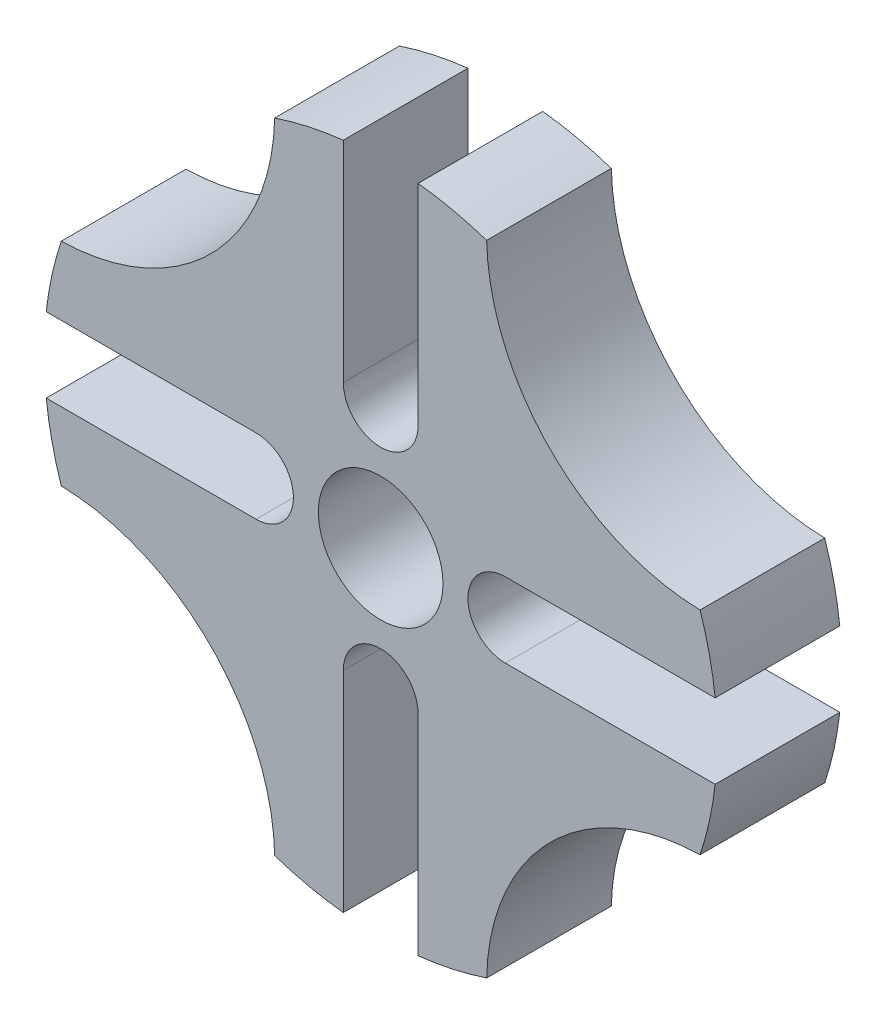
ISO-10303-21;
HEADER;
FILE_DESCRIPTION(('STEP AP214'),'2;1');
FILE_NAME('part.step','',(''),(''),'','','');
FILE_SCHEMA(('AUTOMOTIVE_DESIGN { 1 0 10303 214 1 1 1 1 }'));
ENDSEC;
DATA;
#1=APPLICATION_CONTEXT('core data for automotive mechanical design processes');
#2=APPLICATION_PROTOCOL_DEFINITION('international standard','automotive_design',2000,#1);
#3=PRODUCT_CONTEXT('',#1,'mechanical');
#4=PRODUCT('Part','Part','',(#3));
#5=PRODUCT_RELATED_PRODUCT_CATEGORY('part','',(#4));
#6=PRODUCT_DEFINITION_FORMATION('','',#4);
#7=PRODUCT_DEFINITION_CONTEXT('part definition',#1,'design');
#8=PRODUCT_DEFINITION('design','',#6,#7);
#9=PRODUCT_DEFINITION_SHAPE('','',#8);
#10=(LENGTH_UNIT() NAMED_UNIT(*) SI_UNIT(.MILLI.,.METRE.));
#11=(NAMED_UNIT(*) PLANE_ANGLE_UNIT() SI_UNIT($,.RADIAN.));
#12=(NAMED_UNIT(*) SI_UNIT($,.STERADIAN.) SOLID_ANGLE_UNIT());
#13=UNCERTAINTY_MEASURE_WITH_UNIT(LENGTH_MEASURE(1.E-05),#10,'distance_accuracy_value','');
#14=(GEOMETRIC_REPRESENTATION_CONTEXT(3) GLOBAL_UNCERTAINTY_ASSIGNED_CONTEXT((#13)) GLOBAL_UNIT_ASSIGNED_CONTEXT((#10,
#11,#12)) REPRESENTATION_CONTEXT('',''));
#15=CARTESIAN_POINT('',(0.,0.,0.));
#16=DIRECTION('',(0.,0.,1.));
#17=DIRECTION('',(1.,0.,0.));
#18=AXIS2_PLACEMENT_3D('',#15,#16,#17);
#19=CARTESIAN_POINT('',(0.,0.,10.));
#20=DIRECTION('',(0.,0.,-1.));
#21=DIRECTION('',(-1.,0.,0.));
#22=AXIS2_PLACEMENT_3D('',#19,#20,#21);
#23=CYLINDRICAL_SURFACE('',#22,27.);
#24=CARTESIAN_POINT('',(0.,0.,0.));
#25=DIRECTION('',(0.,0.,1.));
#26=DIRECTION('',(1.,0.,0.));
#27=AXIS2_PLACEMENT_3D('',#24,#25,#26);
#28=CIRCLE('',#27,27.);
#29=CARTESIAN_POINT('',(-2.99999999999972,26.8328157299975,0.));
#30=VERTEX_POINT('',#29);
#31=CARTESIAN_POINT('',(-8.50400104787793,25.6258066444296,0.));
#32=VERTEX_POINT('',#31);
#33=EDGE_CURVE('E365',#30,#32,#28,.T.);
#34=ORIENTED_EDGE('',*,*,#33,.T.);
#35=DIRECTION('',(0.,0.,1.));
#36=VECTOR('',#35,1.);
#37=CARTESIAN_POINT('',(-8.50400104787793,25.6258066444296,0.));
#38=LINE('',#37,#36);
#39=CARTESIAN_POINT('',(-8.50400104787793,25.6258066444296,10.));
#40=VERTEX_POINT('',#39);
#41=EDGE_CURVE('E59',#32,#40,#38,.T.);
#42=ORIENTED_EDGE('',*,*,#41,.T.);
#43=CARTESIAN_POINT('',(0.,0.,10.));
#44=DIRECTION('',(0.,0.,1.));
#45=DIRECTION('',(1.,0.,0.));
#46=AXIS2_PLACEMENT_3D('',#43,#44,#45);
#47=CIRCLE('',#46,27.);
#48=CARTESIAN_POINT('',(-2.99999999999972,26.8328157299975,10.));
#49=VERTEX_POINT('',#48);
#50=EDGE_CURVE('E220',#49,#40,#47,.T.);
#51=ORIENTED_EDGE('',*,*,#50,.F.);
#52=DIRECTION('',(0.,0.,1.));
#53=VECTOR('',#52,1.);
#54=CARTESIAN_POINT('',(-2.99999999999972,26.8328157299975,0.));
#55=LINE('',#54,#53);
#56=EDGE_CURVE('E266',#30,#49,#55,.T.);
#57=ORIENTED_EDGE('',*,*,#56,.F.);
#58=EDGE_LOOP('',(#34,#42,#51,#57));
#59=FACE_BOUND('',#58,.T.);
#60=ADVANCED_FACE('F42',(#59),#23,.T.);
#61=CARTESIAN_POINT('',(-26.8328157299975,-2.99999999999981,0.));
#62=VERTEX_POINT('',#61);
#63=CARTESIAN_POINT('',(-25.6258066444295,-8.50400104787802,0.));
#64=VERTEX_POINT('',#63);
#65=EDGE_CURVE('E364',#62,#64,#28,.T.);
#66=ORIENTED_EDGE('',*,*,#65,.T.);
#67=DIRECTION('',(0.,0.,1.));
#68=VECTOR('',#67,1.);
#69=CARTESIAN_POINT('',(-25.6258066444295,-8.50400104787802,0.));
#70=LINE('',#69,#68);
#71=CARTESIAN_POINT('',(-25.6258066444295,-8.50400104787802,10.));
#72=VERTEX_POINT('',#71);
#73=EDGE_CURVE('E67',#64,#72,#70,.T.);
#74=ORIENTED_EDGE('',*,*,#73,.T.);
#75=CARTESIAN_POINT('',(-26.8328157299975,-2.99999999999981,10.));
#76=VERTEX_POINT('',#75);
#77=EDGE_CURVE('E226',#76,#72,#47,.T.);
#78=ORIENTED_EDGE('',*,*,#77,.F.);
#79=DIRECTION('',(0.,0.,1.));
#80=VECTOR('',#79,1.);
#81=CARTESIAN_POINT('',(-26.8328157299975,-2.99999999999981,0.));
#82=LINE('',#81,#80);
#83=EDGE_CURVE('E295',#62,#76,#82,.T.);
#84=ORIENTED_EDGE('',*,*,#83,.F.);
#85=EDGE_LOOP('',(#66,#74,#78,#84));
#86=FACE_BOUND('',#85,.T.);
#87=ADVANCED_FACE('F433',(#86),#23,.T.);
#88=CARTESIAN_POINT('',(2.99999999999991,-26.8328157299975,0.));
#89=VERTEX_POINT('',#88);
#90=CARTESIAN_POINT('',(8.50400104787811,-25.6258066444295,0.));
#91=VERTEX_POINT('',#90);
#92=EDGE_CURVE('E243',#89,#91,#28,.T.);
#93=ORIENTED_EDGE('',*,*,#92,.T.);
#94=DIRECTION('',(0.,0.,1.));
#95=VECTOR('',#94,1.);
#96=CARTESIAN_POINT('',(8.50400104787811,-25.6258066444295,0.));
#97=LINE('',#96,#95);
#98=CARTESIAN_POINT('',(8.50400104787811,-25.6258066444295,10.));
#99=VERTEX_POINT('',#98);
#100=EDGE_CURVE('E396',#91,#99,#97,.T.);
#101=ORIENTED_EDGE('',*,*,#100,.T.);
#102=CARTESIAN_POINT('',(2.99999999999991,-26.8328157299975,10.));
#103=VERTEX_POINT('',#102);
#104=EDGE_CURVE('E52',#103,#99,#47,.T.);
#105=ORIENTED_EDGE('',*,*,#104,.F.);
#106=DIRECTION('',(0.,0.,1.));
#107=VECTOR('',#106,1.);
#108=CARTESIAN_POINT('',(2.99999999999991,-26.8328157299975,0.));
#109=LINE('',#108,#107);
#110=EDGE_CURVE('E319',#89,#103,#109,.T.);
#111=ORIENTED_EDGE('',*,*,#110,.F.);
#112=EDGE_LOOP('',(#93,#101,#105,#111));
#113=FACE_BOUND('',#112,.T.);
#114=ADVANCED_FACE('F437',(#113),#23,.T.);
#115=CARTESIAN_POINT('',(26.8328157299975,3.,0.));
#116=VERTEX_POINT('',#115);
#117=CARTESIAN_POINT('',(25.6258066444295,8.50400104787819,0.));
#118=VERTEX_POINT('',#117);
#119=EDGE_CURVE('E235',#116,#118,#28,.T.);
#120=ORIENTED_EDGE('',*,*,#119,.T.);
#121=DIRECTION('',(0.,0.,1.));
#122=VECTOR('',#121,1.);
#123=CARTESIAN_POINT('',(25.6258066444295,8.50400104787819,0.));
#124=LINE('',#123,#122);
#125=CARTESIAN_POINT('',(25.6258066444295,8.50400104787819,10.));
#126=VERTEX_POINT('',#125);
#127=EDGE_CURVE('E405',#118,#126,#124,.T.);
#128=ORIENTED_EDGE('',*,*,#127,.T.);
#129=CARTESIAN_POINT('',(26.8328157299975,3.,10.));
#130=VERTEX_POINT('',#129);
#131=EDGE_CURVE('E11',#130,#126,#47,.T.);
#132=ORIENTED_EDGE('',*,*,#131,.F.);
#133=DIRECTION('',(0.,0.,1.));
#134=VECTOR('',#133,1.);
#135=CARTESIAN_POINT('',(26.8328157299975,3.,0.));
#136=LINE('',#135,#134);
#137=EDGE_CURVE('E345',#116,#130,#136,.T.);
#138=ORIENTED_EDGE('',*,*,#137,.F.);
#139=EDGE_LOOP('',(#120,#128,#132,#138));
#140=FACE_BOUND('',#139,.T.);
#141=ADVANCED_FACE('F467',(#140),#23,.T.);
#142=CARTESIAN_POINT('',(-25.6258066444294,8.50400104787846,10.));
#143=VERTEX_POINT('',#142);
#144=CARTESIAN_POINT('',(-26.8328157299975,3.00000000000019,10.));
#145=VERTEX_POINT('',#144);
#146=EDGE_CURVE('E51',#143,#145,#47,.T.);
#147=ORIENTED_EDGE('',*,*,#146,.F.);
#148=DIRECTION('',(0.,0.,1.));
#149=VECTOR('',#148,1.);
#150=CARTESIAN_POINT('',(-25.6258066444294,8.50400104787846,0.));
#151=LINE('',#150,#149);
#152=CARTESIAN_POINT('',(-25.6258066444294,8.50400104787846,0.));
#153=VERTEX_POINT('',#152);
#154=EDGE_CURVE('E203',#153,#143,#151,.T.);
#155=ORIENTED_EDGE('',*,*,#154,.F.);
#156=CARTESIAN_POINT('',(-26.8328157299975,3.00000000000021,0.));
#157=VERTEX_POINT('',#156);
#158=EDGE_CURVE('E242',#153,#157,#28,.T.);
#159=ORIENTED_EDGE('',*,*,#158,.T.);
#160=DIRECTION('',(0.,0.,1.));
#161=VECTOR('',#160,1.);
#162=CARTESIAN_POINT('',(-26.8328157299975,3.00000000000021,0.));
#163=LINE('',#162,#161);
#164=EDGE_CURVE('E225',#157,#145,#163,.T.);
#165=ORIENTED_EDGE('',*,*,#164,.T.);
#166=EDGE_LOOP('',(#147,#155,#159,#165));
#167=FACE_BOUND('',#166,.T.);
#168=ADVANCED_FACE('F223',(#167),#23,.T.);
#169=CARTESIAN_POINT('',(-8.50400104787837,-25.6258066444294,10.));
#170=VERTEX_POINT('',#169);
#171=CARTESIAN_POINT('',(-3.00000000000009,-26.8328157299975,10.));
#172=VERTEX_POINT('',#171);
#173=EDGE_CURVE('E227',#170,#172,#47,.T.);
#174=ORIENTED_EDGE('',*,*,#173,.F.);
#175=DIRECTION('',(0.,0.,1.));
#176=VECTOR('',#175,1.);
#177=CARTESIAN_POINT('',(-8.50400104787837,-25.6258066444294,0.));
#178=LINE('',#177,#176);
#179=CARTESIAN_POINT('',(-8.50400104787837,-25.6258066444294,0.));
#180=VERTEX_POINT('',#179);
#181=EDGE_CURVE('E387',#180,#170,#178,.T.);
#182=ORIENTED_EDGE('',*,*,#181,.F.);
#183=CARTESIAN_POINT('',(-3.00000000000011,-26.8328157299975,0.));
#184=VERTEX_POINT('',#183);
#185=EDGE_CURVE('E358',#180,#184,#28,.T.);
#186=ORIENTED_EDGE('',*,*,#185,.T.);
#187=DIRECTION('',(0.,0.,1.));
#188=VECTOR('',#187,1.);
#189=CARTESIAN_POINT('',(-3.00000000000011,-26.8328157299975,0.));
#190=LINE('',#189,#188);
#191=EDGE_CURVE('E321',#184,#172,#190,.T.);
#192=ORIENTED_EDGE('',*,*,#191,.T.);
#193=EDGE_LOOP('',(#174,#182,#186,#192));
#194=FACE_BOUND('',#193,.T.);
#195=ADVANCED_FACE('F450',(#194),#23,.T.);
#196=CARTESIAN_POINT('',(25.6258066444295,-8.50400104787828,10.));
#197=VERTEX_POINT('',#196);
#198=CARTESIAN_POINT('',(26.8328157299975,-3.,10.));
#199=VERTEX_POINT('',#198);
#200=EDGE_CURVE('E229',#197,#199,#47,.T.);
#201=ORIENTED_EDGE('',*,*,#200,.F.);
#202=DIRECTION('',(0.,0.,1.));
#203=VECTOR('',#202,1.);
#204=CARTESIAN_POINT('',(25.6258066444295,-8.50400104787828,0.));
#205=LINE('',#204,#203);
#206=CARTESIAN_POINT('',(25.6258066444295,-8.50400104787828,0.));
#207=VERTEX_POINT('',#206);
#208=EDGE_CURVE('E395',#207,#197,#205,.T.);
#209=ORIENTED_EDGE('',*,*,#208,.F.);
#210=CARTESIAN_POINT('',(26.8328157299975,-3.00000000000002,0.));
#211=VERTEX_POINT('',#210);
#212=EDGE_CURVE('E355',#207,#211,#28,.T.);
#213=ORIENTED_EDGE('',*,*,#212,.T.);
#214=DIRECTION('',(0.,0.,1.));
#215=VECTOR('',#214,1.);
#216=CARTESIAN_POINT('',(26.8328157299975,-3.00000000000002,0.));
#217=LINE('',#216,#215);
#218=EDGE_CURVE('E347',#211,#199,#217,.T.);
#219=ORIENTED_EDGE('',*,*,#218,.T.);
#220=EDGE_LOOP('',(#201,#209,#213,#219));
#221=FACE_BOUND('',#220,.T.);
#222=ADVANCED_FACE('F441',(#221),#23,.T.);
#223=CARTESIAN_POINT('',(0.,0.,10.));
#224=DIRECTION('',(0.,0.,1.));
#225=DIRECTION('',(1.,0.,0.));
#226=AXIS2_PLACEMENT_3D('',#223,#224,#225);
#227=PLANE('',#226);
#228=CARTESIAN_POINT('',(-25.9999999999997,26.0000000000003,10.));
#229=DIRECTION('',(0.,0.,1.));
#230=DIRECTION('',(0.,1.,0.));
#231=AXIS2_PLACEMENT_3D('',#228,#229,#230);
#232=CIRCLE('',#231,17.5);
#233=EDGE_CURVE('E206',#143,#40,#232,.T.);
#234=ORIENTED_EDGE('',*,*,#233,.F.);
#235=ORIENTED_EDGE('',*,*,#146,.T.);
#236=DIRECTION('',(-1.,0.,0.));
#237=VECTOR('',#236,1.);
#238=CARTESIAN_POINT('',(-9.99999999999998,3.00000000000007,10.));
#239=LINE('',#238,#237);
#240=CARTESIAN_POINT('',(-9.99999999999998,3.00000000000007,10.));
#241=VERTEX_POINT('',#240);
#242=EDGE_CURVE('E277',#241,#145,#239,.T.);
#243=ORIENTED_EDGE('',*,*,#242,.F.);
#244=CARTESIAN_POINT('',(-10.,0.,10.));
#245=DIRECTION('',(0.,0.,1.));
#246=DIRECTION('',(-1.,0.,0.));
#247=AXIS2_PLACEMENT_3D('',#244,#245,#246);
#248=CIRCLE('',#247,3.);
#249=CARTESIAN_POINT('',(-10.,-2.99999999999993,10.));
#250=VERTEX_POINT('',#249);
#251=EDGE_CURVE('E274',#250,#241,#248,.T.);
#252=ORIENTED_EDGE('',*,*,#251,.F.);
#253=DIRECTION('',(1.,0.,0.));
#254=VECTOR('',#253,1.);
#255=CARTESIAN_POINT('',(-10.,-2.99999999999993,10.));
#256=LINE('',#255,#254);
#257=EDGE_CURVE('E279',#76,#250,#256,.T.);
#258=ORIENTED_EDGE('',*,*,#257,.F.);
#259=ORIENTED_EDGE('',*,*,#77,.T.);
#260=CARTESIAN_POINT('',(-26.0000000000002,-25.9999999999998,10.));
#261=DIRECTION('',(0.,0.,1.));
#262=DIRECTION('',(-1.,0.,0.));
#263=AXIS2_PLACEMENT_3D('',#260,#261,#262);
#264=CIRCLE('',#263,17.5);
#265=EDGE_CURVE('E382',#170,#72,#264,.T.);
#266=ORIENTED_EDGE('',*,*,#265,.F.);
#267=ORIENTED_EDGE('',*,*,#173,.T.);
#268=DIRECTION('',(0.,-1.,0.));
#269=VECTOR('',#268,1.);
#270=CARTESIAN_POINT('',(-3.00000000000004,-9.99999999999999,10.));
#271=LINE('',#270,#269);
#272=CARTESIAN_POINT('',(-3.00000000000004,-9.99999999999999,10.));
#273=VERTEX_POINT('',#272);
#274=EDGE_CURVE('E301',#273,#172,#271,.T.);
#275=ORIENTED_EDGE('',*,*,#274,.F.);
#276=CARTESIAN_POINT('',(0.,-10.,10.));
#277=DIRECTION('',(0.,0.,1.));
#278=DIRECTION('',(0.,-1.,0.));
#279=AXIS2_PLACEMENT_3D('',#276,#277,#278);
#280=CIRCLE('',#279,3.);
#281=CARTESIAN_POINT('',(2.99999999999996,-10.,10.));
#282=VERTEX_POINT('',#281);
#283=EDGE_CURVE('E294',#282,#273,#280,.T.);
#284=ORIENTED_EDGE('',*,*,#283,.F.);
#285=DIRECTION('',(0.,1.,0.));
#286=VECTOR('',#285,1.);
#287=CARTESIAN_POINT('',(2.99999999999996,-10.,10.));
#288=LINE('',#287,#286);
#289=EDGE_CURVE('E303',#103,#282,#288,.T.);
#290=ORIENTED_EDGE('',*,*,#289,.F.);
#291=ORIENTED_EDGE('',*,*,#104,.T.);
#292=CARTESIAN_POINT('',(25.9999999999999,-26.0000000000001,10.));
#293=DIRECTION('',(0.,0.,1.));
#294=DIRECTION('',(0.,-1.,0.));
#295=AXIS2_PLACEMENT_3D('',#292,#293,#294);
#296=CIRCLE('',#295,17.5);
#297=EDGE_CURVE('E389',#197,#99,#296,.T.);
#298=ORIENTED_EDGE('',*,*,#297,.F.);
#299=ORIENTED_EDGE('',*,*,#200,.T.);
#300=DIRECTION('',(1.,0.,0.));
#301=VECTOR('',#300,1.);
#302=CARTESIAN_POINT('',(10.,-3.,10.));
#303=LINE('',#302,#301);
#304=CARTESIAN_POINT('',(10.,-3.,10.));
#305=VERTEX_POINT('',#304);
#306=EDGE_CURVE('E327',#305,#199,#303,.T.);
#307=ORIENTED_EDGE('',*,*,#306,.F.);
#308=CARTESIAN_POINT('',(10.,0.,10.));
#309=DIRECTION('',(0.,0.,1.));
#310=DIRECTION('',(1.,0.,0.));
#311=AXIS2_PLACEMENT_3D('',#308,#309,#310);
#312=CIRCLE('',#311,3.);
#313=CARTESIAN_POINT('',(10.,3.,10.));
#314=VERTEX_POINT('',#313);
#315=EDGE_CURVE('E318',#314,#305,#312,.T.);
#316=ORIENTED_EDGE('',*,*,#315,.F.);
#317=DIRECTION('',(-1.,0.,0.));
#318=VECTOR('',#317,1.);
#319=CARTESIAN_POINT('',(10.,3.,10.));
#320=LINE('',#319,#318);
#321=EDGE_CURVE('E329',#130,#314,#320,.T.);
#322=ORIENTED_EDGE('',*,*,#321,.F.);
#323=ORIENTED_EDGE('',*,*,#131,.T.);
#324=CARTESIAN_POINT('',(26.,26.,10.));
#325=DIRECTION('',(0.,0.,1.));
#326=DIRECTION('',(1.,0.,0.));
#327=AXIS2_PLACEMENT_3D('',#324,#325,#326);
#328=CIRCLE('',#327,17.5);
#329=CARTESIAN_POINT('',(8.50400104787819,25.6258066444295,10.));
#330=VERTEX_POINT('',#329);
#331=EDGE_CURVE('E250',#330,#126,#328,.T.);
#332=ORIENTED_EDGE('',*,*,#331,.F.);
#333=CARTESIAN_POINT('',(3.00000000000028,26.8328157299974,10.));
#334=VERTEX_POINT('',#333);
#335=EDGE_CURVE('E50',#330,#334,#47,.T.);
#336=ORIENTED_EDGE('',*,*,#335,.T.);
#337=DIRECTION('',(0.,1.,0.));
#338=VECTOR('',#337,1.);
#339=CARTESIAN_POINT('',(3.0000000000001,9.99999999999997,10.));
#340=LINE('',#339,#338);
#341=CARTESIAN_POINT('',(3.0000000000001,9.99999999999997,10.));
#342=VERTEX_POINT('',#341);
#343=EDGE_CURVE('E249',#342,#334,#340,.T.);
#344=ORIENTED_EDGE('',*,*,#343,.F.);
#345=CARTESIAN_POINT('',(1.04744500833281E-13,10.,10.));
#346=DIRECTION('',(0.,0.,1.));
#347=DIRECTION('',(0.,1.,0.));
#348=AXIS2_PLACEMENT_3D('',#345,#346,#347);
#349=CIRCLE('',#348,3.);
#350=CARTESIAN_POINT('',(-2.9999999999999,10.,10.));
#351=VERTEX_POINT('',#350);
#352=EDGE_CURVE('E263',#351,#342,#349,.T.);
#353=ORIENTED_EDGE('',*,*,#352,.F.);
#354=DIRECTION('',(0.,-1.,0.));
#355=VECTOR('',#354,1.);
#356=CARTESIAN_POINT('',(-2.9999999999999,10.,10.));
#357=LINE('',#356,#355);
#358=EDGE_CURVE('E262',#49,#351,#357,.T.);
#359=ORIENTED_EDGE('',*,*,#358,.F.);
#360=ORIENTED_EDGE('',*,*,#50,.T.);
#361=EDGE_LOOP('',(#234,#235,#243,#252,#258,#259,#266,#267,#275,#284,#290,#291,#298,#299,#307,
#316,#322,#323,#332,#336,#344,#353,#359,#360));
#362=FACE_BOUND('',#361,.T.);
#363=CARTESIAN_POINT('',(0.,0.,10.));
#364=DIRECTION('',(0.,0.,1.));
#365=DIRECTION('',(1.,0.,0.));
#366=AXIS2_PLACEMENT_3D('',#363,#364,#365);
#367=CIRCLE('',#366,5.);
#368=CARTESIAN_POINT('',(5.,0.,10.));
#369=VERTEX_POINT('',#368);
#370=EDGE_CURVE('E353',#369,#369,#367,.T.);
#371=ORIENTED_EDGE('',*,*,#370,.F.);
#372=EDGE_LOOP('',(#371));
#373=FACE_BOUND('',#372,.T.);
#374=ADVANCED_FACE('F214',(#362,#373),#227,.T.);
#375=CARTESIAN_POINT('',(0.,0.,0.));
#376=DIRECTION('',(0.,0.,1.));
#377=DIRECTION('',(1.,0.,0.));
#378=AXIS2_PLACEMENT_3D('',#375,#376,#377);
#379=PLANE('',#378);
#380=ORIENTED_EDGE('',*,*,#158,.F.);
#381=CARTESIAN_POINT('',(-25.9999999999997,26.0000000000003,0.));
#382=DIRECTION('',(0.,0.,1.));
#383=DIRECTION('',(0.,1.,0.));
#384=AXIS2_PLACEMENT_3D('',#381,#382,#383);
#385=CIRCLE('',#384,17.5);
#386=EDGE_CURVE('E207',#153,#32,#385,.T.);
#387=ORIENTED_EDGE('',*,*,#386,.T.);
#388=ORIENTED_EDGE('',*,*,#33,.F.);
#389=DIRECTION('',(0.,-1.,0.));
#390=VECTOR('',#389,1.);
#391=CARTESIAN_POINT('',(-2.9999999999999,10.,0.));
#392=LINE('',#391,#390);
#393=CARTESIAN_POINT('',(-2.9999999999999,10.,0.));
#394=VERTEX_POINT('',#393);
#395=EDGE_CURVE('E270',#30,#394,#392,.T.);
#396=ORIENTED_EDGE('',*,*,#395,.T.);
#397=CARTESIAN_POINT('',(1.04744500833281E-13,10.,0.));
#398=DIRECTION('',(0.,0.,1.));
#399=DIRECTION('',(0.,1.,0.));
#400=AXIS2_PLACEMENT_3D('',#397,#398,#399);
#401=CIRCLE('',#400,3.);
#402=CARTESIAN_POINT('',(3.0000000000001,9.99999999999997,0.));
#403=VERTEX_POINT('',#402);
#404=EDGE_CURVE('E412',#394,#403,#401,.T.);
#405=ORIENTED_EDGE('',*,*,#404,.T.);
#406=DIRECTION('',(0.,1.,0.));
#407=VECTOR('',#406,1.);
#408=CARTESIAN_POINT('',(3.0000000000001,9.99999999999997,0.));
#409=LINE('',#408,#407);
#410=CARTESIAN_POINT('',(3.0000000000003,26.8328157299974,0.));
#411=VERTEX_POINT('',#410);
#412=EDGE_CURVE('E414',#403,#411,#409,.T.);
#413=ORIENTED_EDGE('',*,*,#412,.T.);
#414=CARTESIAN_POINT('',(8.50400104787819,25.6258066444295,0.));
#415=VERTEX_POINT('',#414);
#416=EDGE_CURVE('E241',#415,#411,#28,.T.);
#417=ORIENTED_EDGE('',*,*,#416,.F.);
#418=CARTESIAN_POINT('',(26.,26.,0.));
#419=DIRECTION('',(0.,0.,1.));
#420=DIRECTION('',(1.,0.,0.));
#421=AXIS2_PLACEMENT_3D('',#418,#419,#420);
#422=CIRCLE('',#421,17.5);
#423=EDGE_CURVE('E401',#415,#118,#422,.T.);
#424=ORIENTED_EDGE('',*,*,#423,.T.);
#425=ORIENTED_EDGE('',*,*,#119,.F.);
#426=DIRECTION('',(-1.,0.,0.));
#427=VECTOR('',#426,1.);
#428=CARTESIAN_POINT('',(10.,3.,0.));
#429=LINE('',#428,#427);
#430=CARTESIAN_POINT('',(10.,3.,0.));
#431=VERTEX_POINT('',#430);
#432=EDGE_CURVE('E338',#116,#431,#429,.T.);
#433=ORIENTED_EDGE('',*,*,#432,.T.);
#434=CARTESIAN_POINT('',(10.,0.,0.));
#435=DIRECTION('',(0.,0.,1.));
#436=DIRECTION('',(1.,0.,0.));
#437=AXIS2_PLACEMENT_3D('',#434,#435,#436);
#438=CIRCLE('',#437,3.);
#439=CARTESIAN_POINT('',(10.,-3.,0.));
#440=VERTEX_POINT('',#439);
#441=EDGE_CURVE('E332',#431,#440,#438,.T.);
#442=ORIENTED_EDGE('',*,*,#441,.T.);
#443=DIRECTION('',(1.,0.,0.));
#444=VECTOR('',#443,1.);
#445=CARTESIAN_POINT('',(10.,-3.,0.));
#446=LINE('',#445,#444);
#447=EDGE_CURVE('E335',#440,#211,#446,.T.);
#448=ORIENTED_EDGE('',*,*,#447,.T.);
#449=ORIENTED_EDGE('',*,*,#212,.F.);
#450=CARTESIAN_POINT('',(25.9999999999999,-26.0000000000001,0.));
#451=DIRECTION('',(0.,0.,1.));
#452=DIRECTION('',(0.,-1.,0.));
#453=AXIS2_PLACEMENT_3D('',#450,#451,#452);
#454=CIRCLE('',#453,17.5);
#455=EDGE_CURVE('E392',#207,#91,#454,.T.);
#456=ORIENTED_EDGE('',*,*,#455,.T.);
#457=ORIENTED_EDGE('',*,*,#92,.F.);
#458=DIRECTION('',(0.,1.,0.));
#459=VECTOR('',#458,1.);
#460=CARTESIAN_POINT('',(2.99999999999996,-10.,0.));
#461=LINE('',#460,#459);
#462=CARTESIAN_POINT('',(2.99999999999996,-10.,0.));
#463=VERTEX_POINT('',#462);
#464=EDGE_CURVE('E312',#89,#463,#461,.T.);
#465=ORIENTED_EDGE('',*,*,#464,.T.);
#466=CARTESIAN_POINT('',(0.,-10.,0.));
#467=DIRECTION('',(0.,0.,1.));
#468=DIRECTION('',(0.,-1.,0.));
#469=AXIS2_PLACEMENT_3D('',#466,#467,#468);
#470=CIRCLE('',#469,3.);
#471=CARTESIAN_POINT('',(-3.00000000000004,-9.99999999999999,0.));
#472=VERTEX_POINT('',#471);
#473=EDGE_CURVE('E306',#463,#472,#470,.T.);
#474=ORIENTED_EDGE('',*,*,#473,.T.);
#475=DIRECTION('',(0.,-1.,0.));
#476=VECTOR('',#475,1.);
#477=CARTESIAN_POINT('',(-3.00000000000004,-9.99999999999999,0.));
#478=LINE('',#477,#476);
#479=EDGE_CURVE('E309',#472,#184,#478,.T.);
#480=ORIENTED_EDGE('',*,*,#479,.T.);
#481=ORIENTED_EDGE('',*,*,#185,.F.);
#482=CARTESIAN_POINT('',(-26.0000000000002,-25.9999999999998,0.));
#483=DIRECTION('',(0.,0.,1.));
#484=DIRECTION('',(-1.,0.,0.));
#485=AXIS2_PLACEMENT_3D('',#482,#483,#484);
#486=CIRCLE('',#485,17.5);
#487=EDGE_CURVE('E385',#180,#64,#486,.T.);
#488=ORIENTED_EDGE('',*,*,#487,.T.);
#489=ORIENTED_EDGE('',*,*,#65,.F.);
#490=DIRECTION('',(1.,0.,0.));
#491=VECTOR('',#490,1.);
#492=CARTESIAN_POINT('',(-10.,-2.99999999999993,0.));
#493=LINE('',#492,#491);
#494=CARTESIAN_POINT('',(-10.,-2.99999999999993,0.));
#495=VERTEX_POINT('',#494);
#496=EDGE_CURVE('E288',#62,#495,#493,.T.);
#497=ORIENTED_EDGE('',*,*,#496,.T.);
#498=CARTESIAN_POINT('',(-10.,0.,0.));
#499=DIRECTION('',(0.,0.,1.));
#500=DIRECTION('',(-1.,0.,0.));
#501=AXIS2_PLACEMENT_3D('',#498,#499,#500);
#502=CIRCLE('',#501,3.);
#503=CARTESIAN_POINT('',(-9.99999999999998,3.00000000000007,0.));
#504=VERTEX_POINT('',#503);
#505=EDGE_CURVE('E282',#495,#504,#502,.T.);
#506=ORIENTED_EDGE('',*,*,#505,.T.);
#507=DIRECTION('',(-1.,0.,0.));
#508=VECTOR('',#507,1.);
#509=CARTESIAN_POINT('',(-9.99999999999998,3.00000000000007,0.));
#510=LINE('',#509,#508);
#511=EDGE_CURVE('E285',#504,#157,#510,.T.);
#512=ORIENTED_EDGE('',*,*,#511,.T.);
#513=EDGE_LOOP('',(#380,#387,#388,#396,#405,#413,#417,#424,#425,#433,#442,#448,#449,#456,#457,
#465,#474,#480,#481,#488,#489,#497,#506,#512));
#514=FACE_BOUND('',#513,.T.);
#515=CARTESIAN_POINT('',(0.,0.,0.));
#516=DIRECTION('',(0.,0.,1.));
#517=DIRECTION('',(1.,0.,0.));
#518=AXIS2_PLACEMENT_3D('',#515,#516,#517);
#519=CIRCLE('',#518,5.);
#520=CARTESIAN_POINT('',(5.,0.,0.));
#521=VERTEX_POINT('',#520);
#522=EDGE_CURVE('E344',#521,#521,#519,.T.);
#523=ORIENTED_EDGE('',*,*,#522,.T.);
#524=EDGE_LOOP('',(#523));
#525=FACE_BOUND('',#524,.T.);
#526=ADVANCED_FACE('F377',(#514,#525),#379,.F.);
#527=ORIENTED_EDGE('',*,*,#335,.F.);
#528=DIRECTION('',(0.,0.,1.));
#529=VECTOR('',#528,1.);
#530=CARTESIAN_POINT('',(8.50400104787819,25.6258066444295,0.));
#531=LINE('',#530,#529);
#532=EDGE_CURVE('E404',#415,#330,#531,.T.);
#533=ORIENTED_EDGE('',*,*,#532,.F.);
#534=ORIENTED_EDGE('',*,*,#416,.T.);
#535=DIRECTION('',(0.,0.,1.));
#536=VECTOR('',#535,1.);
#537=CARTESIAN_POINT('',(3.0000000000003,26.8328157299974,0.));
#538=LINE('',#537,#536);
#539=EDGE_CURVE('E258',#411,#334,#538,.T.);
#540=ORIENTED_EDGE('',*,*,#539,.T.);
#541=EDGE_LOOP('',(#527,#533,#534,#540));
#542=FACE_BOUND('',#541,.T.);
#543=ADVANCED_FACE('F44',(#542),#23,.T.);
#544=CARTESIAN_POINT('',(0.,0.,10.));
#545=DIRECTION('',(0.,0.,-1.));
#546=DIRECTION('',(-1.,0.,0.));
#547=AXIS2_PLACEMENT_3D('',#544,#545,#546);
#548=CYLINDRICAL_SURFACE('',#547,5.);
#549=ORIENTED_EDGE('',*,*,#370,.T.);
#550=EDGE_LOOP('',(#549));
#551=FACE_BOUND('',#550,.T.);
#552=ORIENTED_EDGE('',*,*,#522,.F.);
#553=EDGE_LOOP('',(#552));
#554=FACE_BOUND('',#553,.T.);
#555=ADVANCED_FACE('F440',(#551,#554),#548,.F.);
#556=CARTESIAN_POINT('',(10.,0.,0.));
#557=DIRECTION('',(0.,0.,1.));
#558=DIRECTION('',(1.,0.,0.));
#559=AXIS2_PLACEMENT_3D('',#556,#557,#558);
#560=CYLINDRICAL_SURFACE('',#559,3.);
#561=ORIENTED_EDGE('',*,*,#315,.T.);
#562=DIRECTION('',(0.,0.,1.));
#563=VECTOR('',#562,1.);
#564=CARTESIAN_POINT('',(10.,-3.,0.));
#565=LINE('',#564,#563);
#566=EDGE_CURVE('E341',#440,#305,#565,.T.);
#567=ORIENTED_EDGE('',*,*,#566,.F.);
#568=ORIENTED_EDGE('',*,*,#441,.F.);
#569=DIRECTION('',(0.,0.,1.));
#570=VECTOR('',#569,1.);
#571=CARTESIAN_POINT('',(10.,3.,0.));
#572=LINE('',#571,#570);
#573=EDGE_CURVE('E342',#431,#314,#572,.T.);
#574=ORIENTED_EDGE('',*,*,#573,.T.);
#575=EDGE_LOOP('',(#561,#567,#568,#574));
#576=FACE_BOUND('',#575,.T.);
#577=ADVANCED_FACE('F446',(#576),#560,.F.);
#578=CARTESIAN_POINT('',(10.,3.,0.));
#579=DIRECTION('',(0.,1.,0.));
#580=DIRECTION('',(0.,0.,1.));
#581=AXIS2_PLACEMENT_3D('',#578,#579,#580);
#582=PLANE('',#581);
#583=ORIENTED_EDGE('',*,*,#321,.T.);
#584=ORIENTED_EDGE('',*,*,#573,.F.);
#585=ORIENTED_EDGE('',*,*,#432,.F.);
#586=ORIENTED_EDGE('',*,*,#137,.T.);
#587=EDGE_LOOP('',(#583,#584,#585,#586));
#588=FACE_BOUND('',#587,.T.);
#589=ADVANCED_FACE('F639',(#588),#582,.F.);
#590=CARTESIAN_POINT('',(10.,-3.,0.));
#591=DIRECTION('',(0.,-1.,0.));
#592=DIRECTION('',(0.,0.,-1.));
#593=AXIS2_PLACEMENT_3D('',#590,#591,#592);
#594=PLANE('',#593);
#595=ORIENTED_EDGE('',*,*,#306,.T.);
#596=ORIENTED_EDGE('',*,*,#218,.F.);
#597=ORIENTED_EDGE('',*,*,#447,.F.);
#598=ORIENTED_EDGE('',*,*,#566,.T.);
#599=EDGE_LOOP('',(#595,#596,#597,#598));
#600=FACE_BOUND('',#599,.T.);
#601=ADVANCED_FACE('F457',(#600),#594,.F.);
#602=CARTESIAN_POINT('',(0.,-10.,0.));
#603=DIRECTION('',(0.,0.,1.));
#604=DIRECTION('',(1.,0.,0.));
#605=AXIS2_PLACEMENT_3D('',#602,#603,#604);
#606=CYLINDRICAL_SURFACE('',#605,3.);
#607=ORIENTED_EDGE('',*,*,#283,.T.);
#608=DIRECTION('',(0.,0.,1.));
#609=VECTOR('',#608,1.);
#610=CARTESIAN_POINT('',(-3.00000000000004,-9.99999999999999,0.));
#611=LINE('',#610,#609);
#612=EDGE_CURVE('E315',#472,#273,#611,.T.);
#613=ORIENTED_EDGE('',*,*,#612,.F.);
#614=ORIENTED_EDGE('',*,*,#473,.F.);
#615=DIRECTION('',(0.,0.,1.));
#616=VECTOR('',#615,1.);
#617=CARTESIAN_POINT('',(2.99999999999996,-10.,0.));
#618=LINE('',#617,#616);
#619=EDGE_CURVE('E316',#463,#282,#618,.T.);
#620=ORIENTED_EDGE('',*,*,#619,.T.);
#621=EDGE_LOOP('',(#607,#613,#614,#620));
#622=FACE_BOUND('',#621,.T.);
#623=ADVANCED_FACE('F622',(#622),#606,.F.);
#624=CARTESIAN_POINT('',(2.99999999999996,-10.,0.));
#625=DIRECTION('',(1.,0.,0.));
#626=DIRECTION('',(0.,1.,0.));
#627=AXIS2_PLACEMENT_3D('',#624,#625,#626);
#628=PLANE('',#627);
#629=ORIENTED_EDGE('',*,*,#289,.T.);
#630=ORIENTED_EDGE('',*,*,#619,.F.);
#631=ORIENTED_EDGE('',*,*,#464,.F.);
#632=ORIENTED_EDGE('',*,*,#110,.T.);
#633=EDGE_LOOP('',(#629,#630,#631,#632));
#634=FACE_BOUND('',#633,.T.);
#635=ADVANCED_FACE('F612',(#634),#628,.F.);
#636=CARTESIAN_POINT('',(-3.00000000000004,-9.99999999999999,0.));
#637=DIRECTION('',(-1.,0.,0.));
#638=DIRECTION('',(0.,-1.,0.));
#639=AXIS2_PLACEMENT_3D('',#636,#637,#638);
#640=PLANE('',#639);
#641=ORIENTED_EDGE('',*,*,#274,.T.);
#642=ORIENTED_EDGE('',*,*,#191,.F.);
#643=ORIENTED_EDGE('',*,*,#479,.F.);
#644=ORIENTED_EDGE('',*,*,#612,.T.);
#645=EDGE_LOOP('',(#641,#642,#643,#644));
#646=FACE_BOUND('',#645,.T.);
#647=ADVANCED_FACE('F602',(#646),#640,.F.);
#648=CARTESIAN_POINT('',(-10.,0.,0.));
#649=DIRECTION('',(0.,0.,1.));
#650=DIRECTION('',(1.,0.,0.));
#651=AXIS2_PLACEMENT_3D('',#648,#649,#650);
#652=CYLINDRICAL_SURFACE('',#651,3.);
#653=ORIENTED_EDGE('',*,*,#251,.T.);
#654=DIRECTION('',(0.,0.,1.));
#655=VECTOR('',#654,1.);
#656=CARTESIAN_POINT('',(-9.99999999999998,3.00000000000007,0.));
#657=LINE('',#656,#655);
#658=EDGE_CURVE('E291',#504,#241,#657,.T.);
#659=ORIENTED_EDGE('',*,*,#658,.F.);
#660=ORIENTED_EDGE('',*,*,#505,.F.);
#661=DIRECTION('',(0.,0.,1.));
#662=VECTOR('',#661,1.);
#663=CARTESIAN_POINT('',(-10.,-2.99999999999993,0.));
#664=LINE('',#663,#662);
#665=EDGE_CURVE('E292',#495,#250,#664,.T.);
#666=ORIENTED_EDGE('',*,*,#665,.T.);
#667=EDGE_LOOP('',(#653,#659,#660,#666));
#668=FACE_BOUND('',#667,.T.);
#669=ADVANCED_FACE('F592',(#668),#652,.F.);
#670=CARTESIAN_POINT('',(-10.,-2.99999999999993,0.));
#671=DIRECTION('',(0.,-1.,0.));
#672=DIRECTION('',(1.,0.,0.));
#673=AXIS2_PLACEMENT_3D('',#670,#671,#672);
#674=PLANE('',#673);
#675=ORIENTED_EDGE('',*,*,#257,.T.);
#676=ORIENTED_EDGE('',*,*,#665,.F.);
#677=ORIENTED_EDGE('',*,*,#496,.F.);
#678=ORIENTED_EDGE('',*,*,#83,.T.);
#679=EDGE_LOOP('',(#675,#676,#677,#678));
#680=FACE_BOUND('',#679,.T.);
#681=ADVANCED_FACE('F582',(#680),#674,.F.);
#682=CARTESIAN_POINT('',(-9.99999999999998,3.00000000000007,0.));
#683=DIRECTION('',(0.,1.,0.));
#684=DIRECTION('',(-1.,0.,0.));
#685=AXIS2_PLACEMENT_3D('',#682,#683,#684);
#686=PLANE('',#685);
#687=ORIENTED_EDGE('',*,*,#242,.T.);
#688=ORIENTED_EDGE('',*,*,#164,.F.);
#689=ORIENTED_EDGE('',*,*,#511,.F.);
#690=ORIENTED_EDGE('',*,*,#658,.T.);
#691=EDGE_LOOP('',(#687,#688,#689,#690));
#692=FACE_BOUND('',#691,.T.);
#693=ADVANCED_FACE('F429',(#692),#686,.F.);
#694=CARTESIAN_POINT('',(1.04744500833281E-13,10.,0.));
#695=DIRECTION('',(0.,0.,1.));
#696=DIRECTION('',(1.,0.,0.));
#697=AXIS2_PLACEMENT_3D('',#694,#695,#696);
#698=CYLINDRICAL_SURFACE('',#697,3.);
#699=ORIENTED_EDGE('',*,*,#352,.T.);
#700=DIRECTION('',(0.,0.,1.));
#701=VECTOR('',#700,1.);
#702=CARTESIAN_POINT('',(3.0000000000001,9.99999999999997,0.));
#703=LINE('',#702,#701);
#704=EDGE_CURVE('E260',#403,#342,#703,.T.);
#705=ORIENTED_EDGE('',*,*,#704,.F.);
#706=ORIENTED_EDGE('',*,*,#404,.F.);
#707=DIRECTION('',(0.,0.,1.));
#708=VECTOR('',#707,1.);
#709=CARTESIAN_POINT('',(-2.9999999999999,10.,0.));
#710=LINE('',#709,#708);
#711=EDGE_CURVE('E268',#394,#351,#710,.T.);
#712=ORIENTED_EDGE('',*,*,#711,.T.);
#713=EDGE_LOOP('',(#699,#705,#706,#712));
#714=FACE_BOUND('',#713,.T.);
#715=ADVANCED_FACE('F418',(#714),#698,.F.);
#716=CARTESIAN_POINT('',(-2.9999999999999,10.,0.));
#717=DIRECTION('',(-1.,0.,0.));
#718=DIRECTION('',(0.,-1.,0.));
#719=AXIS2_PLACEMENT_3D('',#716,#717,#718);
#720=PLANE('',#719);
#721=ORIENTED_EDGE('',*,*,#358,.T.);
#722=ORIENTED_EDGE('',*,*,#711,.F.);
#723=ORIENTED_EDGE('',*,*,#395,.F.);
#724=ORIENTED_EDGE('',*,*,#56,.T.);
#725=EDGE_LOOP('',(#721,#722,#723,#724));
#726=FACE_BOUND('',#725,.T.);
#727=ADVANCED_FACE('F420',(#726),#720,.F.);
#728=CARTESIAN_POINT('',(3.0000000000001,9.99999999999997,0.));
#729=DIRECTION('',(1.,0.,0.));
#730=DIRECTION('',(0.,1.,0.));
#731=AXIS2_PLACEMENT_3D('',#728,#729,#730);
#732=PLANE('',#731);
#733=ORIENTED_EDGE('',*,*,#343,.T.);
#734=ORIENTED_EDGE('',*,*,#539,.F.);
#735=ORIENTED_EDGE('',*,*,#412,.F.);
#736=ORIENTED_EDGE('',*,*,#704,.T.);
#737=EDGE_LOOP('',(#733,#734,#735,#736));
#738=FACE_BOUND('',#737,.T.);
#739=ADVANCED_FACE('F256',(#738),#732,.F.);
#740=CARTESIAN_POINT('',(26.,26.,0.));
#741=DIRECTION('',(0.,0.,1.));
#742=DIRECTION('',(1.,0.,0.));
#743=AXIS2_PLACEMENT_3D('',#740,#741,#742);
#744=CYLINDRICAL_SURFACE('',#743,17.5);
#745=ORIENTED_EDGE('',*,*,#331,.T.);
#746=ORIENTED_EDGE('',*,*,#127,.F.);
#747=ORIENTED_EDGE('',*,*,#423,.F.);
#748=ORIENTED_EDGE('',*,*,#532,.T.);
#749=EDGE_LOOP('',(#745,#746,#747,#748));
#750=FACE_BOUND('',#749,.T.);
#751=ADVANCED_FACE('F427',(#750),#744,.F.);
#752=CARTESIAN_POINT('',(25.9999999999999,-26.0000000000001,0.));
#753=DIRECTION('',(0.,0.,1.));
#754=DIRECTION('',(1.,0.,0.));
#755=AXIS2_PLACEMENT_3D('',#752,#753,#754);
#756=CYLINDRICAL_SURFACE('',#755,17.5);
#757=ORIENTED_EDGE('',*,*,#297,.T.);
#758=ORIENTED_EDGE('',*,*,#100,.F.);
#759=ORIENTED_EDGE('',*,*,#455,.F.);
#760=ORIENTED_EDGE('',*,*,#208,.T.);
#761=EDGE_LOOP('',(#757,#758,#759,#760));
#762=FACE_BOUND('',#761,.T.);
#763=ADVANCED_FACE('F470',(#762),#756,.F.);
#764=CARTESIAN_POINT('',(-26.0000000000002,-25.9999999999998,0.));
#765=DIRECTION('',(0.,0.,1.));
#766=DIRECTION('',(1.,0.,0.));
#767=AXIS2_PLACEMENT_3D('',#764,#765,#766);
#768=CYLINDRICAL_SURFACE('',#767,17.5);
#769=ORIENTED_EDGE('',*,*,#265,.T.);
#770=ORIENTED_EDGE('',*,*,#73,.F.);
#771=ORIENTED_EDGE('',*,*,#487,.F.);
#772=ORIENTED_EDGE('',*,*,#181,.T.);
#773=EDGE_LOOP('',(#769,#770,#771,#772));
#774=FACE_BOUND('',#773,.T.);
#775=ADVANCED_FACE('F474',(#774),#768,.F.);
#776=CARTESIAN_POINT('',(-25.9999999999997,26.0000000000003,0.));
#777=DIRECTION('',(0.,0.,1.));
#778=DIRECTION('',(1.,0.,0.));
#779=AXIS2_PLACEMENT_3D('',#776,#777,#778);
#780=CYLINDRICAL_SURFACE('',#779,17.5);
#781=ORIENTED_EDGE('',*,*,#233,.T.);
#782=ORIENTED_EDGE('',*,*,#41,.F.);
#783=ORIENTED_EDGE('',*,*,#386,.F.);
#784=ORIENTED_EDGE('',*,*,#154,.T.);
#785=EDGE_LOOP('',(#781,#782,#783,#784));
#786=FACE_BOUND('',#785,.T.);
#787=ADVANCED_FACE('F205',(#786),#780,.F.);
#788=CLOSED_SHELL('',(#60,#87,#114,#141,#168,#195,#222,#374,#526,#543,#555,#577,#589,#601,#623,
#635,#647,#669,#681,#693,#715,#727,#739,#751,#763,#775,#787));
#789=MANIFOLD_SOLID_BREP('B2',#788);
#790=ADVANCED_BREP_SHAPE_REPRESENTATION('',(#18,#789),#14);
#791=SHAPE_DEFINITION_REPRESENTATION(#9,#790);
ENDSEC;
END-ISO-10303-21;
